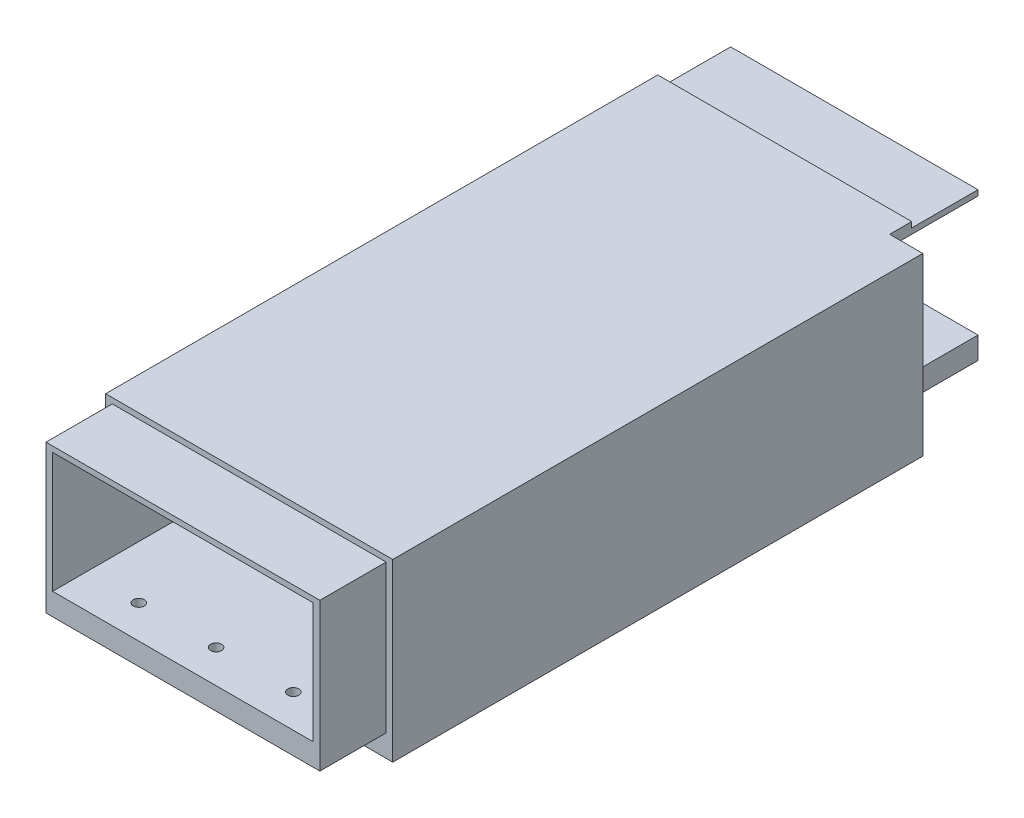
from build123d import *

# Parameters (mm, degrees)
SKETCH_1_W          = 125.075330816
SKETCH_1_H          = 66.992730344
SKETCH_1_W_2        = 118
SKETCH_1_H_2        = 54.492730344
EXTRUDE_1_DEPTH     = 30
SKETCH_2_W          = 130
SKETCH_2_H          = 79.492730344
EXTRUDE_2_DEPTH     = 250
CUT_EXTRUDE_1_REACH = 314.68
SKETCH_3_W          = 118
SKETCH_3_H          = 54.492730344
SKETCH_4_W          = 124
SKETCH_4_H          = 66.992730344
SKETCH_4_W_2        = 118
SKETCH_4_H_2        = 54.492730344
EXTRUDE_3_DEPTH     = 30
CUT_EXTRUDE_2_REACH = 1717.776
SKETCH_5_R          = 2.5
CUT_EXTRUDE_3_REACH = 1717.776
SKETCH_6_R          = 2.5
SKETCH_7_W          = 40
SKETCH_7_H          = 79.492730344
CUT_EXTRUDE_4_DEPTH = 15


with BuildPart() as part:
    # Sketch 1 → Extrude 1 (new body)
    with BuildSketch(Plane.XY.offset(1400)):
        with Locations((-56.764728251, 106.521030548)):
            Rectangle(SKETCH_1_W, SKETCH_1_H)
        with Locations((-57.302393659, 110.271030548)):
            Rectangle(SKETCH_1_W_2, SKETCH_1_H_2, mode=Mode.SUBTRACT)
    extrude(amount=EXTRUDE_1_DEPTH)

    # Sketch 2 → Extrude 2 (add)
    with BuildSketch(Plane.XY.offset(1430)):
        with Locations((-57.302393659, 102.771030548)):
            Rectangle(SKETCH_2_W, SKETCH_2_H)
    extrude(amount=EXTRUDE_2_DEPTH)

    # Sketch 3 → Cut-Extrude 1 (cut, up to next)
    with BuildSketch(Plane(origin=(0, 0, 1430), x_dir=(-1, 0, 0), z_dir=(0, 0, -1)), mode=Mode.PRIVATE) as cut_extrude_1_sk1:
        with Locations((57.302393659, 110.271030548)):
            Rectangle(SKETCH_3_W, SKETCH_3_H)
    cut_extrude_1_tool1 = extrude(cut_extrude_1_sk1.sketch, amount=-CUT_EXTRUDE_1_REACH, mode=Mode.PRIVATE) & part.part
    add(cut_extrude_1_tool1.solids().sort_by_distance((-57.302394, 110.271031, 1430))[0], mode=Mode.SUBTRACT)

    # Sketch 4 → Extrude 3 (add)
    with BuildSketch(Plane.XY.offset(1680)):
        with Locations((-57.302393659, 106.521030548)):
            Rectangle(SKETCH_4_W, SKETCH_4_H)
        with Locations((-57.302393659, 110.271030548)):
            Rectangle(SKETCH_4_W_2, SKETCH_4_H_2, mode=Mode.SUBTRACT)
    extrude(amount=EXTRUDE_3_DEPTH)

    # Sketch 5 → Cut-Extrude 2 (cut, up to next)
    with BuildSketch(Plane.XZ.offset(-73.024665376), mode=Mode.PRIVATE) as cut_extrude_2_sk1:
        with Locations(Location((-92.302393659, 1415, 0), (0, 0, 270))):
            Circle(SKETCH_5_R)
    cut_extrude_2_tool1 = extrude(cut_extrude_2_sk1.sketch, amount=-CUT_EXTRUDE_2_REACH, mode=Mode.PRIVATE) & part.part
    # Sketch 5 → Cut-Extrude 2 (cut, up to next)
    with BuildSketch(Plane.XZ.offset(-73.024665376), mode=Mode.PRIVATE) as cut_extrude_2_sk2:
        with Locations(Location((-57.302393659, 1415, 0), (0, 0, 270))):
            Circle(SKETCH_5_R)
    cut_extrude_2_tool2 = extrude(cut_extrude_2_sk2.sketch, amount=-CUT_EXTRUDE_2_REACH, mode=Mode.PRIVATE) & part.part
    # Sketch 5 → Cut-Extrude 2 (cut, up to next)
    with BuildSketch(Plane.XZ.offset(-73.024665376), mode=Mode.PRIVATE) as cut_extrude_2_sk3:
        with Locations(Location((-22.302393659, 1415, 0), (0, 0, 270))):
            Circle(SKETCH_5_R)
    cut_extrude_2_tool3 = extrude(cut_extrude_2_sk3.sketch, amount=-CUT_EXTRUDE_2_REACH, mode=Mode.PRIVATE) & part.part
    add(cut_extrude_2_tool1.solids().sort_by_distance((-92.302394, 73.024665, 1415))[0], mode=Mode.SUBTRACT)
    add(cut_extrude_2_tool2.solids().sort_by_distance((-57.302394, 73.024665, 1415))[0], mode=Mode.SUBTRACT)
    add(cut_extrude_2_tool3.solids().sort_by_distance((-22.302394, 73.024665, 1415))[0], mode=Mode.SUBTRACT)

    # Sketch 6 → Cut-Extrude 3 (cut, up to next)
    with BuildSketch(Plane.XZ.offset(-73.024665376), mode=Mode.PRIVATE) as cut_extrude_3_sk1:
        with Locations(Location((-92.302393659, 1695, 0), (0, 0, 270))):
            Circle(SKETCH_6_R)
    cut_extrude_3_tool1 = extrude(cut_extrude_3_sk1.sketch, amount=-CUT_EXTRUDE_3_REACH, mode=Mode.PRIVATE) & part.part
    # Sketch 6 → Cut-Extrude 3 (cut, up to next)
    with BuildSketch(Plane.XZ.offset(-73.024665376), mode=Mode.PRIVATE) as cut_extrude_3_sk2:
        with Locations(Location((-57.302393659, 1695, 0), (0, 0, 270))):
            Circle(SKETCH_6_R)
    cut_extrude_3_tool2 = extrude(cut_extrude_3_sk2.sketch, amount=-CUT_EXTRUDE_3_REACH, mode=Mode.PRIVATE) & part.part
    # Sketch 6 → Cut-Extrude 3 (cut, up to next)
    with BuildSketch(Plane.XZ.offset(-73.024665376), mode=Mode.PRIVATE) as cut_extrude_3_sk3:
        with Locations(Location((-22.302393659, 1695, 0), (0, 0, 270))):
            Circle(SKETCH_6_R)
    cut_extrude_3_tool3 = extrude(cut_extrude_3_sk3.sketch, amount=-CUT_EXTRUDE_3_REACH, mode=Mode.PRIVATE) & part.part
    add(cut_extrude_3_tool1.solids().sort_by_distance((-92.302394, 73.024665, 1695))[0], mode=Mode.SUBTRACT)
    add(cut_extrude_3_tool2.solids().sort_by_distance((-57.302394, 73.024665, 1695))[0], mode=Mode.SUBTRACT)
    add(cut_extrude_3_tool3.solids().sort_by_distance((-22.302394, 73.024665, 1695))[0], mode=Mode.SUBTRACT)

    # Sketch 7 → Cut-Extrude 4 (cut)
    with BuildSketch(Plane(origin=(7.697606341, 0, 0), x_dir=(0, 0, -1), z_dir=(1, 0, 0))):
        with Locations((-1420, 102.771030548)):
            Rectangle(SKETCH_7_W, SKETCH_7_H)
    extrude(amount=-CUT_EXTRUDE_4_DEPTH, mode=Mode.SUBTRACT)


solid = part.part
